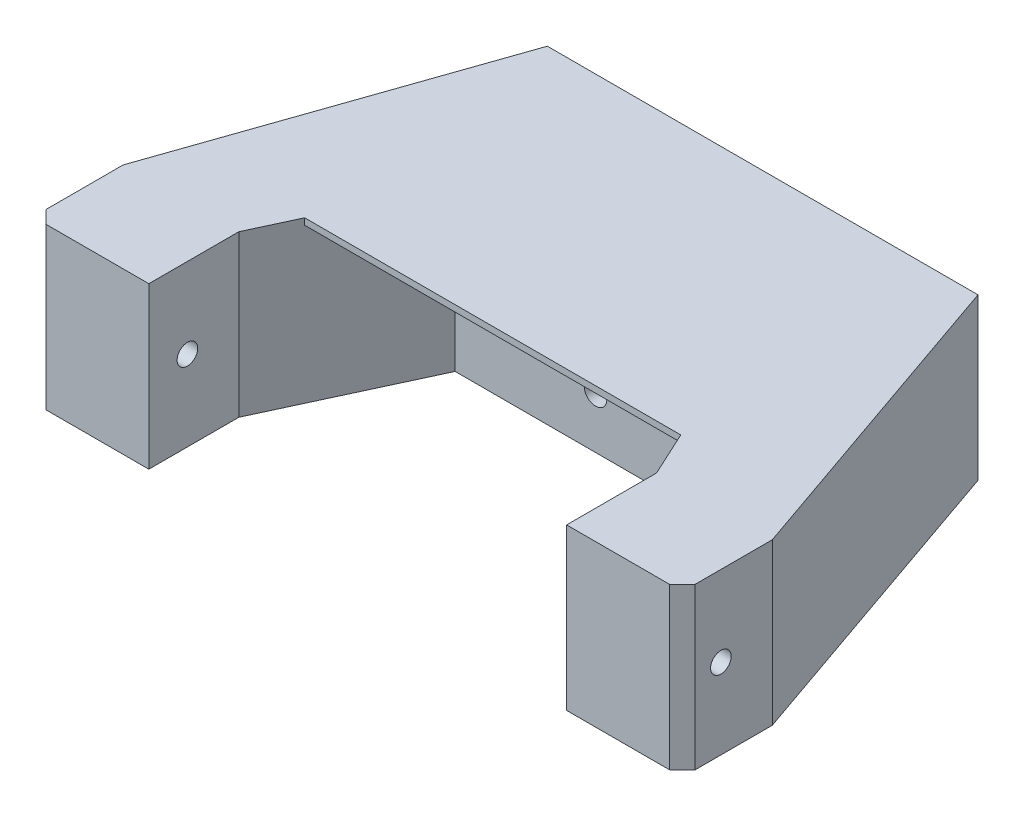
ISO-10303-21;
HEADER;
FILE_DESCRIPTION(('STEP AP214'),'2;1');
FILE_NAME('part.step','',(''),(''),'','','');
FILE_SCHEMA(('AUTOMOTIVE_DESIGN { 1 0 10303 214 1 1 1 1 }'));
ENDSEC;
DATA;
#1=APPLICATION_CONTEXT('core data for automotive mechanical design processes');
#2=APPLICATION_PROTOCOL_DEFINITION('international standard','automotive_design',2000,#1);
#3=PRODUCT_CONTEXT('',#1,'mechanical');
#4=PRODUCT('Part','Part','',(#3));
#5=PRODUCT_RELATED_PRODUCT_CATEGORY('part','',(#4));
#6=PRODUCT_DEFINITION_FORMATION('','',#4);
#7=PRODUCT_DEFINITION_CONTEXT('part definition',#1,'design');
#8=PRODUCT_DEFINITION('design','',#6,#7);
#9=PRODUCT_DEFINITION_SHAPE('','',#8);
#10=(LENGTH_UNIT() NAMED_UNIT(*) SI_UNIT(.MILLI.,.METRE.));
#11=(NAMED_UNIT(*) PLANE_ANGLE_UNIT() SI_UNIT($,.RADIAN.));
#12=(NAMED_UNIT(*) SI_UNIT($,.STERADIAN.) SOLID_ANGLE_UNIT());
#13=UNCERTAINTY_MEASURE_WITH_UNIT(LENGTH_MEASURE(1.E-05),#10,'distance_accuracy_value','');
#14=(GEOMETRIC_REPRESENTATION_CONTEXT(3) GLOBAL_UNCERTAINTY_ASSIGNED_CONTEXT((#13)) GLOBAL_UNIT_ASSIGNED_CONTEXT((#10,
#11,#12)) REPRESENTATION_CONTEXT('',''));
#15=CARTESIAN_POINT('',(0.,0.,0.));
#16=DIRECTION('',(0.,0.,1.));
#17=DIRECTION('',(1.,0.,0.));
#18=AXIS2_PLACEMENT_3D('',#15,#16,#17);
#19=CARTESIAN_POINT('',(0.,8.,5.00000000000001));
#20=DIRECTION('',(0.,0.,-1.));
#21=DIRECTION('',(-1.,0.,0.));
#22=AXIS2_PLACEMENT_3D('',#19,#20,#21);
#23=CYLINDRICAL_SURFACE('',#22,1.75);
#24=CARTESIAN_POINT('',(0.,8.,4.));
#25=DIRECTION('',(0.,0.,1.));
#26=DIRECTION('',(1.,0.,0.));
#27=AXIS2_PLACEMENT_3D('',#24,#25,#26);
#28=CIRCLE('',#27,1.75);
#29=CARTESIAN_POINT('',(1.75,8.,4.));
#30=VERTEX_POINT('',#29);
#31=EDGE_CURVE('E258',#30,#30,#28,.T.);
#32=ORIENTED_EDGE('',*,*,#31,.T.);
#33=EDGE_LOOP('',(#32));
#34=FACE_BOUND('',#33,.T.);
#35=CARTESIAN_POINT('',(0.,8.,-10.));
#36=DIRECTION('',(0.,0.,-1.));
#37=DIRECTION('',(-1.,0.,0.));
#38=AXIS2_PLACEMENT_3D('',#35,#36,#37);
#39=CIRCLE('',#38,1.75);
#40=CARTESIAN_POINT('',(-1.75,8.,-10.));
#41=VERTEX_POINT('',#40);
#42=EDGE_CURVE('E262',#41,#41,#39,.F.);
#43=ORIENTED_EDGE('',*,*,#42,.F.);
#44=EDGE_LOOP('',(#43));
#45=FACE_BOUND('',#44,.T.);
#46=ADVANCED_FACE('F38',(#34,#45),#23,.F.);
#47=CARTESIAN_POINT('',(25.,25.,-10.));
#48=DIRECTION('',(0.,-1.,0.));
#49=DIRECTION('',(0.,0.,-1.));
#50=AXIS2_PLACEMENT_3D('',#47,#48,#49);
#51=CYLINDRICAL_SURFACE('',#50,8.05);
#52=CARTESIAN_POINT('',(25.,0.,-10.));
#53=DIRECTION('',(0.,1.,0.));
#54=DIRECTION('',(0.,0.,1.));
#55=AXIS2_PLACEMENT_3D('',#52,#53,#54);
#56=CIRCLE('',#55,8.05);
#57=CARTESIAN_POINT('',(25.,0.,-1.95));
#58=VERTEX_POINT('',#57);
#59=EDGE_CURVE('E231',#58,#58,#56,.T.);
#60=ORIENTED_EDGE('',*,*,#59,.F.);
#61=EDGE_LOOP('',(#60));
#62=FACE_BOUND('',#61,.T.);
#63=CARTESIAN_POINT('',(25.,24.,-10.));
#64=DIRECTION('',(0.,1.,0.));
#65=DIRECTION('',(0.,0.,1.));
#66=AXIS2_PLACEMENT_3D('',#63,#64,#65);
#67=CIRCLE('',#66,8.05);
#68=CARTESIAN_POINT('',(25.,24.,-1.95));
#69=VERTEX_POINT('',#68);
#70=EDGE_CURVE('E195',#69,#69,#67,.T.);
#71=ORIENTED_EDGE('',*,*,#70,.T.);
#72=EDGE_LOOP('',(#71));
#73=FACE_BOUND('',#72,.T.);
#74=ADVANCED_FACE('F378',(#62,#73),#51,.F.);
#75=CARTESIAN_POINT('',(-25.,25.,-10.));
#76=DIRECTION('',(0.,-1.,0.));
#77=DIRECTION('',(0.,0.,-1.));
#78=AXIS2_PLACEMENT_3D('',#75,#76,#77);
#79=CYLINDRICAL_SURFACE('',#78,8.05);
#80=CARTESIAN_POINT('',(-25.,0.,-10.));
#81=DIRECTION('',(0.,1.,0.));
#82=DIRECTION('',(0.,0.,1.));
#83=AXIS2_PLACEMENT_3D('',#80,#81,#82);
#84=CIRCLE('',#83,8.05);
#85=CARTESIAN_POINT('',(-25.,0.,-1.95));
#86=VERTEX_POINT('',#85);
#87=EDGE_CURVE('E205',#86,#86,#84,.F.);
#88=ORIENTED_EDGE('',*,*,#87,.T.);
#89=EDGE_LOOP('',(#88));
#90=FACE_BOUND('',#89,.T.);
#91=CARTESIAN_POINT('',(-25.,24.,-10.));
#92=DIRECTION('',(0.,1.,0.));
#93=DIRECTION('',(0.,0.,1.));
#94=AXIS2_PLACEMENT_3D('',#91,#92,#93);
#95=CIRCLE('',#94,8.05);
#96=CARTESIAN_POINT('',(-25.,24.,-1.95));
#97=VERTEX_POINT('',#96);
#98=EDGE_CURVE('E250',#97,#97,#95,.F.);
#99=ORIENTED_EDGE('',*,*,#98,.F.);
#100=EDGE_LOOP('',(#99));
#101=FACE_BOUND('',#100,.T.);
#102=ADVANCED_FACE('F384',(#90,#101),#79,.F.);
#103=CARTESIAN_POINT('',(0.,25.,-22.));
#104=DIRECTION('',(0.,0.,-1.));
#105=DIRECTION('',(-1.,0.,0.));
#106=AXIS2_PLACEMENT_3D('',#103,#104,#105);
#107=PLANE('',#106);
#108=CARTESIAN_POINT('',(0.,8.,-22.));
#109=DIRECTION('',(0.,0.,-1.));
#110=DIRECTION('',(-1.,0.,0.));
#111=AXIS2_PLACEMENT_3D('',#108,#109,#110);
#112=CIRCLE('',#111,3.5);
#113=CARTESIAN_POINT('',(-3.5,8.,-22.));
#114=VERTEX_POINT('',#113);
#115=EDGE_CURVE('E336',#114,#114,#112,.T.);
#116=ORIENTED_EDGE('',*,*,#115,.F.);
#117=EDGE_LOOP('',(#116));
#118=FACE_BOUND('',#117,.T.);
#119=DIRECTION('',(1.,0.,0.));
#120=VECTOR('',#119,1.);
#121=CARTESIAN_POINT('',(0.,0.,-22.));
#122=LINE('',#121,#120);
#123=CARTESIAN_POINT('',(-33.5,0.,-22.));
#124=VERTEX_POINT('',#123);
#125=CARTESIAN_POINT('',(33.5,0.,-22.));
#126=VERTEX_POINT('',#125);
#127=EDGE_CURVE('E200',#124,#126,#122,.T.);
#128=ORIENTED_EDGE('',*,*,#127,.F.);
#129=DIRECTION('',(0.,-1.,0.));
#130=VECTOR('',#129,1.);
#131=CARTESIAN_POINT('',(-33.5,25.,-22.));
#132=LINE('',#131,#130);
#133=CARTESIAN_POINT('',(-33.5,25.,-22.));
#134=VERTEX_POINT('',#133);
#135=EDGE_CURVE('E248',#134,#124,#132,.T.);
#136=ORIENTED_EDGE('',*,*,#135,.F.);
#137=DIRECTION('',(1.,0.,0.));
#138=VECTOR('',#137,1.);
#139=CARTESIAN_POINT('',(0.,25.,-22.));
#140=LINE('',#139,#138);
#141=CARTESIAN_POINT('',(33.5,25.,-22.));
#142=VERTEX_POINT('',#141);
#143=EDGE_CURVE('E201',#134,#142,#140,.T.);
#144=ORIENTED_EDGE('',*,*,#143,.T.);
#145=DIRECTION('',(0.,-1.,0.));
#146=VECTOR('',#145,1.);
#147=CARTESIAN_POINT('',(33.5,25.,-22.));
#148=LINE('',#147,#146);
#149=EDGE_CURVE('E216',#142,#126,#148,.T.);
#150=ORIENTED_EDGE('',*,*,#149,.T.);
#151=EDGE_LOOP('',(#128,#136,#144,#150));
#152=FACE_BOUND('',#151,.T.);
#153=ADVANCED_FACE('F40',(#118,#152),#107,.T.);
#154=CARTESIAN_POINT('',(-36.7135687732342,25.,-12.7373605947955));
#155=DIRECTION('',(0.944756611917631,0.,0.327772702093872));
#156=DIRECTION('',(0.327772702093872,0.,-0.944756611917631));
#157=AXIS2_PLACEMENT_3D('',#154,#155,#156);
#158=PLANE('',#157);
#159=DIRECTION('',(-0.327772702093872,0.,0.944756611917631));
#160=VECTOR('',#159,1.);
#161=CARTESIAN_POINT('',(-36.7135687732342,0.,-12.7373605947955));
#162=LINE('',#161,#160);
#163=CARTESIAN_POINT('',(-50.5,0.,27.));
#164=VERTEX_POINT('',#163);
#165=EDGE_CURVE('E219',#124,#164,#162,.T.);
#166=ORIENTED_EDGE('',*,*,#165,.T.);
#167=DIRECTION('',(0.,-1.,0.));
#168=VECTOR('',#167,1.);
#169=CARTESIAN_POINT('',(-50.5,25.,27.));
#170=LINE('',#169,#168);
#171=CARTESIAN_POINT('',(-50.5,25.,27.));
#172=VERTEX_POINT('',#171);
#173=EDGE_CURVE('E245',#172,#164,#170,.T.);
#174=ORIENTED_EDGE('',*,*,#173,.F.);
#175=DIRECTION('',(-0.327772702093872,0.,0.944756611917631));
#176=VECTOR('',#175,1.);
#177=CARTESIAN_POINT('',(-36.7135687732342,25.,-12.7373605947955));
#178=LINE('',#177,#176);
#179=EDGE_CURVE('E204',#134,#172,#178,.T.);
#180=ORIENTED_EDGE('',*,*,#179,.F.);
#181=ORIENTED_EDGE('',*,*,#135,.T.);
#182=EDGE_LOOP('',(#166,#174,#180,#181));
#183=FACE_BOUND('',#182,.T.);
#184=ADVANCED_FACE('F352',(#183),#158,.F.);
#185=CARTESIAN_POINT('',(-16.469923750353,25.,-7.6249646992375));
#186=DIRECTION('',(-0.907466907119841,0.,-0.420123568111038));
#187=DIRECTION('',(-0.420123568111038,0.,0.907466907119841));
#188=AXIS2_PLACEMENT_3D('',#185,#186,#187);
#189=PLANE('',#188);
#190=DIRECTION('',(0.420123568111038,0.,-0.907466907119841));
#191=VECTOR('',#190,1.);
#192=CARTESIAN_POINT('',(-16.469923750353,0.,-7.6249646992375));
#193=LINE('',#192,#191);
#194=CARTESIAN_POINT('',(-32.5,0.,27.));
#195=VERTEX_POINT('',#194);
#196=CARTESIAN_POINT('',(-21.8518518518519,0.,3.99999999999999));
#197=VERTEX_POINT('',#196);
#198=EDGE_CURVE('E222',#195,#197,#193,.T.);
#199=ORIENTED_EDGE('',*,*,#198,.T.);
#200=DIRECTION('',(0.,-1.,0.));
#201=VECTOR('',#200,1.);
#202=CARTESIAN_POINT('',(-21.8518518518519,67.886372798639,3.99999999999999));
#203=LINE('',#202,#201);
#204=CARTESIAN_POINT('',(-21.8518518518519,24.,3.99999999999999));
#205=VERTEX_POINT('',#204);
#206=EDGE_CURVE('E330',#205,#197,#203,.T.);
#207=ORIENTED_EDGE('',*,*,#206,.F.);
#208=DIRECTION('',(-0.420123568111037,0.,0.907466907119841));
#209=VECTOR('',#208,1.);
#210=CARTESIAN_POINT('',(-20.,24.,0.));
#211=LINE('',#210,#209);
#212=CARTESIAN_POINT('',(-29.2592592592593,24.,20.));
#213=VERTEX_POINT('',#212);
#214=EDGE_CURVE('E183',#205,#213,#211,.T.);
#215=ORIENTED_EDGE('',*,*,#214,.T.);
#216=DIRECTION('',(0.,1.,0.));
#217=VECTOR('',#216,1.);
#218=CARTESIAN_POINT('',(-29.2592592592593,24.,20.));
#219=LINE('',#218,#217);
#220=CARTESIAN_POINT('',(-29.2592592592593,25.,20.));
#221=VERTEX_POINT('',#220);
#222=EDGE_CURVE('E190',#213,#221,#219,.T.);
#223=ORIENTED_EDGE('',*,*,#222,.T.);
#224=DIRECTION('',(0.420123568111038,0.,-0.907466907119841));
#225=VECTOR('',#224,1.);
#226=CARTESIAN_POINT('',(-16.469923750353,25.,-7.6249646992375));
#227=LINE('',#226,#225);
#228=CARTESIAN_POINT('',(-32.5,25.,27.));
#229=VERTEX_POINT('',#228);
#230=EDGE_CURVE('E207',#229,#221,#227,.T.);
#231=ORIENTED_EDGE('',*,*,#230,.F.);
#232=DIRECTION('',(0.,-1.,0.));
#233=VECTOR('',#232,1.);
#234=CARTESIAN_POINT('',(-32.5,25.,27.));
#235=LINE('',#234,#233);
#236=EDGE_CURVE('E242',#229,#195,#235,.T.);
#237=ORIENTED_EDGE('',*,*,#236,.T.);
#238=EDGE_LOOP('',(#199,#207,#215,#223,#231,#237));
#239=FACE_BOUND('',#238,.T.);
#240=ADVANCED_FACE('F299',(#239),#189,.F.);
#241=CARTESIAN_POINT('',(16.469923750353,25.,-7.6249646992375));
#242=DIRECTION('',(-0.907466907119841,0.,0.420123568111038));
#243=DIRECTION('',(0.420123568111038,0.,0.907466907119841));
#244=AXIS2_PLACEMENT_3D('',#241,#242,#243);
#245=PLANE('',#244);
#246=DIRECTION('',(0.,-1.,0.));
#247=VECTOR('',#246,1.);
#248=CARTESIAN_POINT('',(21.8518518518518,67.886372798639,4.));
#249=LINE('',#248,#247);
#250=CARTESIAN_POINT('',(21.8518518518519,24.,4.));
#251=VERTEX_POINT('',#250);
#252=CARTESIAN_POINT('',(21.8518518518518,0.,4.));
#253=VERTEX_POINT('',#252);
#254=EDGE_CURVE('E332',#251,#253,#249,.T.);
#255=ORIENTED_EDGE('',*,*,#254,.T.);
#256=DIRECTION('',(-0.420123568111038,0.,-0.907466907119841));
#257=VECTOR('',#256,1.);
#258=CARTESIAN_POINT('',(16.469923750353,0.,-7.6249646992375));
#259=LINE('',#258,#257);
#260=CARTESIAN_POINT('',(32.5,0.,27.));
#261=VERTEX_POINT('',#260);
#262=EDGE_CURVE('E225',#261,#253,#259,.T.);
#263=ORIENTED_EDGE('',*,*,#262,.F.);
#264=DIRECTION('',(0.,-1.,0.));
#265=VECTOR('',#264,1.);
#266=CARTESIAN_POINT('',(32.5,25.,27.));
#267=LINE('',#266,#265);
#268=CARTESIAN_POINT('',(32.5,25.,27.));
#269=VERTEX_POINT('',#268);
#270=EDGE_CURVE('E240',#269,#261,#267,.T.);
#271=ORIENTED_EDGE('',*,*,#270,.F.);
#272=DIRECTION('',(-0.420123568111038,0.,-0.907466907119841));
#273=VECTOR('',#272,1.);
#274=CARTESIAN_POINT('',(16.469923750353,25.,-7.6249646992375));
#275=LINE('',#274,#273);
#276=CARTESIAN_POINT('',(29.2592592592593,25.,20.));
#277=VERTEX_POINT('',#276);
#278=EDGE_CURVE('E210',#269,#277,#275,.T.);
#279=ORIENTED_EDGE('',*,*,#278,.T.);
#280=DIRECTION('',(0.,1.,0.));
#281=VECTOR('',#280,1.);
#282=CARTESIAN_POINT('',(29.2592592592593,24.,20.));
#283=LINE('',#282,#281);
#284=CARTESIAN_POINT('',(29.2592592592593,24.,20.));
#285=VERTEX_POINT('',#284);
#286=EDGE_CURVE('E193',#285,#277,#283,.T.);
#287=ORIENTED_EDGE('',*,*,#286,.F.);
#288=DIRECTION('',(-0.420123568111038,0.,-0.907466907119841));
#289=VECTOR('',#288,1.);
#290=CARTESIAN_POINT('',(29.2592592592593,24.,20.));
#291=LINE('',#290,#289);
#292=EDGE_CURVE('E187',#285,#251,#291,.T.);
#293=ORIENTED_EDGE('',*,*,#292,.T.);
#294=EDGE_LOOP('',(#255,#263,#271,#279,#287,#293));
#295=FACE_BOUND('',#294,.T.);
#296=ADVANCED_FACE('F314',(#295),#245,.T.);
#297=CARTESIAN_POINT('',(36.7135687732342,25.,-12.7373605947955));
#298=DIRECTION('',(0.944756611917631,0.,-0.327772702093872));
#299=DIRECTION('',(-0.327772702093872,0.,-0.944756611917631));
#300=AXIS2_PLACEMENT_3D('',#297,#298,#299);
#301=PLANE('',#300);
#302=DIRECTION('',(0.327772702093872,0.,0.944756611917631));
#303=VECTOR('',#302,1.);
#304=CARTESIAN_POINT('',(36.7135687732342,0.,-12.7373605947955));
#305=LINE('',#304,#303);
#306=CARTESIAN_POINT('',(50.5,0.,27.));
#307=VERTEX_POINT('',#306);
#308=EDGE_CURVE('E228',#126,#307,#305,.T.);
#309=ORIENTED_EDGE('',*,*,#308,.F.);
#310=ORIENTED_EDGE('',*,*,#149,.F.);
#311=DIRECTION('',(0.327772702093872,0.,0.944756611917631));
#312=VECTOR('',#311,1.);
#313=CARTESIAN_POINT('',(36.7135687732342,25.,-12.7373605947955));
#314=LINE('',#313,#312);
#315=CARTESIAN_POINT('',(50.5,25.,27.));
#316=VERTEX_POINT('',#315);
#317=EDGE_CURVE('E213',#142,#316,#314,.T.);
#318=ORIENTED_EDGE('',*,*,#317,.T.);
#319=DIRECTION('',(0.,-1.,0.));
#320=VECTOR('',#319,1.);
#321=CARTESIAN_POINT('',(50.5,25.,27.));
#322=LINE('',#321,#320);
#323=EDGE_CURVE('E237',#316,#307,#322,.T.);
#324=ORIENTED_EDGE('',*,*,#323,.T.);
#325=EDGE_LOOP('',(#309,#310,#318,#324));
#326=FACE_BOUND('',#325,.T.);
#327=ADVANCED_FACE('F359',(#326),#301,.T.);
#328=CARTESIAN_POINT('',(0.,25.,0.));
#329=DIRECTION('',(0.,1.,0.));
#330=DIRECTION('',(0.,0.,1.));
#331=AXIS2_PLACEMENT_3D('',#328,#329,#330);
#332=PLANE('',#331);
#333=DIRECTION('',(-0.707106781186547,0.,-0.707106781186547));
#334=VECTOR('',#333,1.);
#335=CARTESIAN_POINT('',(-50.5,25.,39.));
#336=LINE('',#335,#334);
#337=CARTESIAN_POINT('',(-48.5,25.,41.));
#338=VERTEX_POINT('',#337);
#339=CARTESIAN_POINT('',(-50.5,25.,39.));
#340=VERTEX_POINT('',#339);
#341=EDGE_CURVE('E149',#338,#340,#336,.T.);
#342=ORIENTED_EDGE('',*,*,#341,.F.);
#343=DIRECTION('',(-1.,0.,0.));
#344=VECTOR('',#343,1.);
#345=CARTESIAN_POINT('',(-50.5,25.,41.));
#346=LINE('',#345,#344);
#347=CARTESIAN_POINT('',(-32.5,25.,41.));
#348=VERTEX_POINT('',#347);
#349=EDGE_CURVE('E159',#348,#338,#346,.T.);
#350=ORIENTED_EDGE('',*,*,#349,.F.);
#351=DIRECTION('',(0.,0.,-1.));
#352=VECTOR('',#351,1.);
#353=CARTESIAN_POINT('',(-32.5,25.,41.));
#354=LINE('',#353,#352);
#355=EDGE_CURVE('E170',#348,#229,#354,.T.);
#356=ORIENTED_EDGE('',*,*,#355,.T.);
#357=ORIENTED_EDGE('',*,*,#230,.T.);
#358=DIRECTION('',(1.,0.,0.));
#359=VECTOR('',#358,1.);
#360=CARTESIAN_POINT('',(-29.2592592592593,25.,20.));
#361=LINE('',#360,#359);
#362=EDGE_CURVE('E182',#221,#277,#361,.T.);
#363=ORIENTED_EDGE('',*,*,#362,.T.);
#364=ORIENTED_EDGE('',*,*,#278,.F.);
#365=DIRECTION('',(0.,0.,-1.));
#366=VECTOR('',#365,1.);
#367=CARTESIAN_POINT('',(32.5,25.,41.));
#368=LINE('',#367,#366);
#369=CARTESIAN_POINT('',(32.5,25.,41.));
#370=VERTEX_POINT('',#369);
#371=EDGE_CURVE('E276',#370,#269,#368,.T.);
#372=ORIENTED_EDGE('',*,*,#371,.F.);
#373=DIRECTION('',(-1.,0.,0.));
#374=VECTOR('',#373,1.);
#375=CARTESIAN_POINT('',(32.5,25.,41.));
#376=LINE('',#375,#374);
#377=CARTESIAN_POINT('',(48.5,25.,41.));
#378=VERTEX_POINT('',#377);
#379=EDGE_CURVE('E270',#378,#370,#376,.T.);
#380=ORIENTED_EDGE('',*,*,#379,.F.);
#381=DIRECTION('',(-0.707106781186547,0.,0.707106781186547));
#382=VECTOR('',#381,1.);
#383=CARTESIAN_POINT('',(50.5,25.,39.));
#384=LINE('',#383,#382);
#385=CARTESIAN_POINT('',(50.5,25.,39.));
#386=VERTEX_POINT('',#385);
#387=EDGE_CURVE('E60',#386,#378,#384,.T.);
#388=ORIENTED_EDGE('',*,*,#387,.F.);
#389=DIRECTION('',(0.,0.,-1.));
#390=VECTOR('',#389,1.);
#391=CARTESIAN_POINT('',(50.5,25.,41.));
#392=LINE('',#391,#390);
#393=EDGE_CURVE('E279',#386,#316,#392,.T.);
#394=ORIENTED_EDGE('',*,*,#393,.T.);
#395=ORIENTED_EDGE('',*,*,#317,.F.);
#396=ORIENTED_EDGE('',*,*,#143,.F.);
#397=ORIENTED_EDGE('',*,*,#179,.T.);
#398=DIRECTION('',(0.,0.,-1.));
#399=VECTOR('',#398,1.);
#400=CARTESIAN_POINT('',(-50.5,25.,41.));
#401=LINE('',#400,#399);
#402=EDGE_CURVE('E161',#340,#172,#401,.T.);
#403=ORIENTED_EDGE('',*,*,#402,.F.);
#404=EDGE_LOOP('',(#342,#350,#356,#357,#363,#364,#372,#380,#388,#394,#395,#396,#397,#403));
#405=FACE_BOUND('',#404,.T.);
#406=ADVANCED_FACE('F157',(#405),#332,.T.);
#407=CARTESIAN_POINT('',(0.,0.,0.));
#408=DIRECTION('',(0.,1.,0.));
#409=DIRECTION('',(0.,0.,1.));
#410=AXIS2_PLACEMENT_3D('',#407,#408,#409);
#411=PLANE('',#410);
#412=DIRECTION('',(1.,0.,0.));
#413=VECTOR('',#412,1.);
#414=CARTESIAN_POINT('',(-50.5,0.,41.));
#415=LINE('',#414,#413);
#416=CARTESIAN_POINT('',(-48.5,0.,41.));
#417=VERTEX_POINT('',#416);
#418=CARTESIAN_POINT('',(-32.5,0.,41.));
#419=VERTEX_POINT('',#418);
#420=EDGE_CURVE('E172',#417,#419,#415,.T.);
#421=ORIENTED_EDGE('',*,*,#420,.F.);
#422=DIRECTION('',(-0.707106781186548,0.,-0.707106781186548));
#423=VECTOR('',#422,1.);
#424=CARTESIAN_POINT('',(-44.75,0.,44.75));
#425=LINE('',#424,#423);
#426=CARTESIAN_POINT('',(-50.5,0.,39.));
#427=VERTEX_POINT('',#426);
#428=EDGE_CURVE('E52',#417,#427,#425,.T.);
#429=ORIENTED_EDGE('',*,*,#428,.T.);
#430=DIRECTION('',(0.,0.,-1.));
#431=VECTOR('',#430,1.);
#432=CARTESIAN_POINT('',(-50.5,0.,41.));
#433=LINE('',#432,#431);
#434=EDGE_CURVE('E180',#427,#164,#433,.T.);
#435=ORIENTED_EDGE('',*,*,#434,.T.);
#436=ORIENTED_EDGE('',*,*,#165,.F.);
#437=ORIENTED_EDGE('',*,*,#127,.T.);
#438=ORIENTED_EDGE('',*,*,#308,.T.);
#439=DIRECTION('',(0.,0.,-1.));
#440=VECTOR('',#439,1.);
#441=CARTESIAN_POINT('',(50.5,0.,41.));
#442=LINE('',#441,#440);
#443=CARTESIAN_POINT('',(50.5,0.,39.));
#444=VERTEX_POINT('',#443);
#445=EDGE_CURVE('E286',#444,#307,#442,.T.);
#446=ORIENTED_EDGE('',*,*,#445,.F.);
#447=DIRECTION('',(-0.707106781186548,0.,0.707106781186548));
#448=VECTOR('',#447,1.);
#449=CARTESIAN_POINT('',(44.75,0.,44.75));
#450=LINE('',#449,#448);
#451=CARTESIAN_POINT('',(48.5,0.,41.));
#452=VERTEX_POINT('',#451);
#453=EDGE_CURVE('E321',#444,#452,#450,.T.);
#454=ORIENTED_EDGE('',*,*,#453,.T.);
#455=DIRECTION('',(1.,0.,0.));
#456=VECTOR('',#455,1.);
#457=CARTESIAN_POINT('',(32.5,0.,41.));
#458=LINE('',#457,#456);
#459=CARTESIAN_POINT('',(32.5,0.,41.));
#460=VERTEX_POINT('',#459);
#461=EDGE_CURVE('E272',#460,#452,#458,.T.);
#462=ORIENTED_EDGE('',*,*,#461,.F.);
#463=DIRECTION('',(0.,0.,-1.));
#464=VECTOR('',#463,1.);
#465=CARTESIAN_POINT('',(32.5,0.,41.));
#466=LINE('',#465,#464);
#467=EDGE_CURVE('E288',#460,#261,#466,.T.);
#468=ORIENTED_EDGE('',*,*,#467,.T.);
#469=ORIENTED_EDGE('',*,*,#262,.T.);
#470=DIRECTION('',(-1.,0.,0.));
#471=VECTOR('',#470,1.);
#472=CARTESIAN_POINT('',(21.8518518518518,0.,4.));
#473=LINE('',#472,#471);
#474=EDGE_CURVE('E261',#253,#197,#473,.T.);
#475=ORIENTED_EDGE('',*,*,#474,.T.);
#476=ORIENTED_EDGE('',*,*,#198,.F.);
#477=DIRECTION('',(0.,0.,-1.));
#478=VECTOR('',#477,1.);
#479=CARTESIAN_POINT('',(-32.5,0.,41.));
#480=LINE('',#479,#478);
#481=EDGE_CURVE('E177',#419,#195,#480,.T.);
#482=ORIENTED_EDGE('',*,*,#481,.F.);
#483=EDGE_LOOP('',(#421,#429,#435,#436,#437,#438,#446,#454,#462,#468,#469,#475,#476,#482));
#484=FACE_BOUND('',#483,.T.);
#485=ORIENTED_EDGE('',*,*,#59,.T.);
#486=EDGE_LOOP('',(#485));
#487=FACE_BOUND('',#486,.T.);
#488=ORIENTED_EDGE('',*,*,#87,.F.);
#489=EDGE_LOOP('',(#488));
#490=FACE_BOUND('',#489,.T.);
#491=ADVANCED_FACE('F292',(#484,#487,#490),#411,.F.);
#492=CARTESIAN_POINT('',(-25.,24.,-10.));
#493=DIRECTION('',(0.,1.,0.));
#494=DIRECTION('',(0.,0.,1.));
#495=AXIS2_PLACEMENT_3D('',#492,#493,#494);
#496=PLANE('',#495);
#497=ORIENTED_EDGE('',*,*,#98,.T.);
#498=EDGE_LOOP('',(#497));
#499=FACE_BOUND('',#498,.T.);
#500=ADVANCED_FACE('F421',(#499),#496,.F.);
#501=CARTESIAN_POINT('',(25.,24.,-10.));
#502=DIRECTION('',(0.,1.,0.));
#503=DIRECTION('',(0.,0.,1.));
#504=AXIS2_PLACEMENT_3D('',#501,#502,#503);
#505=PLANE('',#504);
#506=ORIENTED_EDGE('',*,*,#70,.F.);
#507=EDGE_LOOP('',(#506));
#508=FACE_BOUND('',#507,.T.);
#509=ADVANCED_FACE('F418',(#508),#505,.F.);
#510=CARTESIAN_POINT('',(-29.2592592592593,24.,20.));
#511=DIRECTION('',(0.,0.,1.));
#512=DIRECTION('',(1.,0.,0.));
#513=AXIS2_PLACEMENT_3D('',#510,#511,#512);
#514=PLANE('',#513);
#515=ORIENTED_EDGE('',*,*,#362,.F.);
#516=ORIENTED_EDGE('',*,*,#222,.F.);
#517=DIRECTION('',(1.,0.,0.));
#518=VECTOR('',#517,1.);
#519=CARTESIAN_POINT('',(-29.2592592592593,24.,20.));
#520=LINE('',#519,#518);
#521=EDGE_CURVE('E185',#213,#285,#520,.T.);
#522=ORIENTED_EDGE('',*,*,#521,.T.);
#523=ORIENTED_EDGE('',*,*,#286,.T.);
#524=EDGE_LOOP('',(#515,#516,#522,#523));
#525=FACE_BOUND('',#524,.T.);
#526=ADVANCED_FACE('F305',(#525),#514,.T.);
#527=CARTESIAN_POINT('',(0.,24.,0.));
#528=DIRECTION('',(0.,1.,0.));
#529=DIRECTION('',(0.,0.,1.));
#530=AXIS2_PLACEMENT_3D('',#527,#528,#529);
#531=PLANE('',#530);
#532=ORIENTED_EDGE('',*,*,#214,.F.);
#533=DIRECTION('',(-1.,0.,0.));
#534=VECTOR('',#533,1.);
#535=CARTESIAN_POINT('',(21.8518518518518,24.,4.));
#536=LINE('',#535,#534);
#537=EDGE_CURVE('E311',#251,#205,#536,.T.);
#538=ORIENTED_EDGE('',*,*,#537,.F.);
#539=ORIENTED_EDGE('',*,*,#292,.F.);
#540=ORIENTED_EDGE('',*,*,#521,.F.);
#541=EDGE_LOOP('',(#532,#538,#539,#540));
#542=FACE_BOUND('',#541,.T.);
#543=ADVANCED_FACE('F308',(#542),#531,.F.);
#544=CARTESIAN_POINT('',(-50.5,25.,41.));
#545=DIRECTION('',(1.,0.,0.));
#546=DIRECTION('',(0.,0.,-1.));
#547=AXIS2_PLACEMENT_3D('',#544,#545,#546);
#548=PLANE('',#547);
#549=CARTESIAN_POINT('',(-50.5,12.5,35.));
#550=DIRECTION('',(-1.,0.,0.));
#551=DIRECTION('',(0.,0.,1.));
#552=AXIS2_PLACEMENT_3D('',#549,#550,#551);
#553=CIRCLE('',#552,1.6);
#554=CARTESIAN_POINT('',(-50.5,12.5,36.6));
#555=VERTEX_POINT('',#554);
#556=EDGE_CURVE('E257',#555,#555,#553,.T.);
#557=ORIENTED_EDGE('',*,*,#556,.F.);
#558=EDGE_LOOP('',(#557));
#559=FACE_BOUND('',#558,.T.);
#560=ORIENTED_EDGE('',*,*,#434,.F.);
#561=DIRECTION('',(0.,1.,0.));
#562=VECTOR('',#561,1.);
#563=CARTESIAN_POINT('',(-50.5,-60.,39.));
#564=LINE('',#563,#562);
#565=EDGE_CURVE('E162',#427,#340,#564,.T.);
#566=ORIENTED_EDGE('',*,*,#565,.T.);
#567=ORIENTED_EDGE('',*,*,#402,.T.);
#568=ORIENTED_EDGE('',*,*,#173,.T.);
#569=EDGE_LOOP('',(#560,#566,#567,#568));
#570=FACE_BOUND('',#569,.T.);
#571=ADVANCED_FACE('F347',(#559,#570),#548,.F.);
#572=CARTESIAN_POINT('',(-32.5,25.,41.));
#573=DIRECTION('',(-1.,0.,0.));
#574=DIRECTION('',(0.,0.,1.));
#575=AXIS2_PLACEMENT_3D('',#572,#573,#574);
#576=PLANE('',#575);
#577=CARTESIAN_POINT('',(-32.5,12.5,35.));
#578=DIRECTION('',(-1.,0.,0.));
#579=DIRECTION('',(0.,0.,1.));
#580=AXIS2_PLACEMENT_3D('',#577,#578,#579);
#581=CIRCLE('',#580,1.6);
#582=CARTESIAN_POINT('',(-32.5,12.5,36.6));
#583=VERTEX_POINT('',#582);
#584=EDGE_CURVE('E322',#583,#583,#581,.T.);
#585=ORIENTED_EDGE('',*,*,#584,.T.);
#586=EDGE_LOOP('',(#585));
#587=FACE_BOUND('',#586,.T.);
#588=ORIENTED_EDGE('',*,*,#236,.F.);
#589=ORIENTED_EDGE('',*,*,#355,.F.);
#590=DIRECTION('',(0.,1.,0.));
#591=VECTOR('',#590,1.);
#592=CARTESIAN_POINT('',(-32.5,25.,41.));
#593=LINE('',#592,#591);
#594=EDGE_CURVE('E167',#419,#348,#593,.T.);
#595=ORIENTED_EDGE('',*,*,#594,.F.);
#596=ORIENTED_EDGE('',*,*,#481,.T.);
#597=EDGE_LOOP('',(#588,#589,#595,#596));
#598=FACE_BOUND('',#597,.T.);
#599=ADVANCED_FACE('F297',(#587,#598),#576,.F.);
#600=CARTESIAN_POINT('',(0.,0.,41.));
#601=DIRECTION('',(0.,0.,1.));
#602=DIRECTION('',(1.,0.,0.));
#603=AXIS2_PLACEMENT_3D('',#600,#601,#602);
#604=PLANE('',#603);
#605=DIRECTION('',(0.,1.,0.));
#606=VECTOR('',#605,1.);
#607=CARTESIAN_POINT('',(-48.5,0.,41.));
#608=LINE('',#607,#606);
#609=EDGE_CURVE('E11',#417,#338,#608,.T.);
#610=ORIENTED_EDGE('',*,*,#609,.F.);
#611=ORIENTED_EDGE('',*,*,#420,.T.);
#612=ORIENTED_EDGE('',*,*,#594,.T.);
#613=ORIENTED_EDGE('',*,*,#349,.T.);
#614=EDGE_LOOP('',(#610,#611,#612,#613));
#615=FACE_BOUND('',#614,.T.);
#616=ADVANCED_FACE('F165',(#615),#604,.T.);
#617=CARTESIAN_POINT('',(32.5,0.,41.));
#618=DIRECTION('',(1.,0.,0.));
#619=DIRECTION('',(0.,0.,-1.));
#620=AXIS2_PLACEMENT_3D('',#617,#618,#619);
#621=PLANE('',#620);
#622=CARTESIAN_POINT('',(32.5,12.5,35.));
#623=DIRECTION('',(1.,0.,0.));
#624=DIRECTION('',(0.,0.,-1.));
#625=AXIS2_PLACEMENT_3D('',#622,#623,#624);
#626=CIRCLE('',#625,1.6);
#627=CARTESIAN_POINT('',(32.5,12.5,33.4));
#628=VERTEX_POINT('',#627);
#629=EDGE_CURVE('E256',#628,#628,#626,.T.);
#630=ORIENTED_EDGE('',*,*,#629,.T.);
#631=EDGE_LOOP('',(#630));
#632=FACE_BOUND('',#631,.T.);
#633=ORIENTED_EDGE('',*,*,#270,.T.);
#634=ORIENTED_EDGE('',*,*,#467,.F.);
#635=DIRECTION('',(0.,-1.,0.));
#636=VECTOR('',#635,1.);
#637=CARTESIAN_POINT('',(32.5,0.,41.));
#638=LINE('',#637,#636);
#639=EDGE_CURVE('E281',#370,#460,#638,.T.);
#640=ORIENTED_EDGE('',*,*,#639,.F.);
#641=ORIENTED_EDGE('',*,*,#371,.T.);
#642=EDGE_LOOP('',(#633,#634,#640,#641));
#643=FACE_BOUND('',#642,.T.);
#644=ADVANCED_FACE('F319',(#632,#643),#621,.F.);
#645=CARTESIAN_POINT('',(50.5,0.,41.));
#646=DIRECTION('',(-1.,0.,0.));
#647=DIRECTION('',(0.,0.,1.));
#648=AXIS2_PLACEMENT_3D('',#645,#646,#647);
#649=PLANE('',#648);
#650=CARTESIAN_POINT('',(50.5,12.5,35.));
#651=DIRECTION('',(-1.,0.,0.));
#652=DIRECTION('',(0.,0.,1.));
#653=AXIS2_PLACEMENT_3D('',#650,#651,#652);
#654=CIRCLE('',#653,1.6);
#655=CARTESIAN_POINT('',(50.5,12.5,36.6));
#656=VERTEX_POINT('',#655);
#657=EDGE_CURVE('E253',#656,#656,#654,.T.);
#658=ORIENTED_EDGE('',*,*,#657,.T.);
#659=EDGE_LOOP('',(#658));
#660=FACE_BOUND('',#659,.T.);
#661=ORIENTED_EDGE('',*,*,#393,.F.);
#662=DIRECTION('',(0.,1.,0.));
#663=VECTOR('',#662,1.);
#664=CARTESIAN_POINT('',(50.5,-60.,39.));
#665=LINE('',#664,#663);
#666=EDGE_CURVE('E163',#444,#386,#665,.T.);
#667=ORIENTED_EDGE('',*,*,#666,.F.);
#668=ORIENTED_EDGE('',*,*,#445,.T.);
#669=ORIENTED_EDGE('',*,*,#323,.F.);
#670=EDGE_LOOP('',(#661,#667,#668,#669));
#671=FACE_BOUND('',#670,.T.);
#672=ADVANCED_FACE('F362',(#660,#671),#649,.F.);
#673=CARTESIAN_POINT('',(0.,0.,41.));
#674=DIRECTION('',(0.,0.,-1.));
#675=DIRECTION('',(-1.,0.,0.));
#676=AXIS2_PLACEMENT_3D('',#673,#674,#675);
#677=PLANE('',#676);
#678=ORIENTED_EDGE('',*,*,#461,.T.);
#679=DIRECTION('',(0.,1.,0.));
#680=VECTOR('',#679,1.);
#681=CARTESIAN_POINT('',(48.5,0.,41.));
#682=LINE('',#681,#680);
#683=EDGE_CURVE('E46',#452,#378,#682,.T.);
#684=ORIENTED_EDGE('',*,*,#683,.T.);
#685=ORIENTED_EDGE('',*,*,#379,.T.);
#686=ORIENTED_EDGE('',*,*,#639,.T.);
#687=EDGE_LOOP('',(#678,#684,#685,#686));
#688=FACE_BOUND('',#687,.T.);
#689=ADVANCED_FACE('F268',(#688),#677,.F.);
#690=CARTESIAN_POINT('',(180.5,12.5,35.));
#691=DIRECTION('',(-1.,0.,0.));
#692=DIRECTION('',(0.,0.,1.));
#693=AXIS2_PLACEMENT_3D('',#690,#691,#692);
#694=CYLINDRICAL_SURFACE('',#693,1.6);
#695=ORIENTED_EDGE('',*,*,#657,.F.);
#696=EDGE_LOOP('',(#695));
#697=FACE_BOUND('',#696,.T.);
#698=ORIENTED_EDGE('',*,*,#629,.F.);
#699=EDGE_LOOP('',(#698));
#700=FACE_BOUND('',#699,.T.);
#701=ADVANCED_FACE('F396',(#697,#700),#694,.F.);
#702=ORIENTED_EDGE('',*,*,#556,.T.);
#703=EDGE_LOOP('',(#702));
#704=FACE_BOUND('',#703,.T.);
#705=ORIENTED_EDGE('',*,*,#584,.F.);
#706=EDGE_LOOP('',(#705));
#707=FACE_BOUND('',#706,.T.);
#708=ADVANCED_FACE('F392',(#704,#707),#694,.F.);
#709=CARTESIAN_POINT('',(21.8518518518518,67.886372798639,4.));
#710=DIRECTION('',(0.,0.,1.));
#711=DIRECTION('',(1.,0.,0.));
#712=AXIS2_PLACEMENT_3D('',#709,#710,#711);
#713=PLANE('',#712);
#714=ORIENTED_EDGE('',*,*,#31,.F.);
#715=EDGE_LOOP('',(#714));
#716=FACE_BOUND('',#715,.T.);
#717=ORIENTED_EDGE('',*,*,#254,.F.);
#718=ORIENTED_EDGE('',*,*,#537,.T.);
#719=ORIENTED_EDGE('',*,*,#206,.T.);
#720=ORIENTED_EDGE('',*,*,#474,.F.);
#721=EDGE_LOOP('',(#717,#718,#719,#720));
#722=FACE_BOUND('',#721,.T.);
#723=ADVANCED_FACE('F389',(#716,#722),#713,.T.);
#724=CARTESIAN_POINT('',(0.,8.,-10.));
#725=DIRECTION('',(0.,0.,-1.));
#726=DIRECTION('',(-1.,0.,0.));
#727=AXIS2_PLACEMENT_3D('',#724,#725,#726);
#728=PLANE('',#727);
#729=CARTESIAN_POINT('',(0.,8.,-10.));
#730=DIRECTION('',(0.,0.,-1.));
#731=DIRECTION('',(-1.,0.,0.));
#732=AXIS2_PLACEMENT_3D('',#729,#730,#731);
#733=CIRCLE('',#732,3.5);
#734=CARTESIAN_POINT('',(-3.5,8.,-10.));
#735=VERTEX_POINT('',#734);
#736=EDGE_CURVE('E264',#735,#735,#733,.T.);
#737=ORIENTED_EDGE('',*,*,#736,.T.);
#738=EDGE_LOOP('',(#737));
#739=FACE_BOUND('',#738,.T.);
#740=ORIENTED_EDGE('',*,*,#42,.T.);
#741=EDGE_LOOP('',(#740));
#742=FACE_BOUND('',#741,.T.);
#743=ADVANCED_FACE('F373',(#739,#742),#728,.T.);
#744=CARTESIAN_POINT('',(0.,8.,-10.));
#745=DIRECTION('',(0.,0.,-1.));
#746=DIRECTION('',(-1.,0.,0.));
#747=AXIS2_PLACEMENT_3D('',#744,#745,#746);
#748=CYLINDRICAL_SURFACE('',#747,3.5);
#749=ORIENTED_EDGE('',*,*,#736,.F.);
#750=EDGE_LOOP('',(#749));
#751=FACE_BOUND('',#750,.T.);
#752=ORIENTED_EDGE('',*,*,#115,.T.);
#753=EDGE_LOOP('',(#752));
#754=FACE_BOUND('',#753,.T.);
#755=ADVANCED_FACE('F366',(#751,#754),#748,.F.);
#756=CARTESIAN_POINT('',(50.5,-60.,39.));
#757=DIRECTION('',(-0.707106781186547,0.,-0.707106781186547));
#758=DIRECTION('',(-0.707106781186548,0.,0.707106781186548));
#759=AXIS2_PLACEMENT_3D('',#756,#757,#758);
#760=PLANE('',#759);
#761=ORIENTED_EDGE('',*,*,#666,.T.);
#762=ORIENTED_EDGE('',*,*,#387,.T.);
#763=ORIENTED_EDGE('',*,*,#683,.F.);
#764=ORIENTED_EDGE('',*,*,#453,.F.);
#765=EDGE_LOOP('',(#761,#762,#763,#764));
#766=FACE_BOUND('',#765,.T.);
#767=ADVANCED_FACE('F364',(#766),#760,.F.);
#768=CARTESIAN_POINT('',(-50.5,-60.,39.));
#769=DIRECTION('',(0.707106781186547,0.,-0.707106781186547));
#770=DIRECTION('',(-0.707106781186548,0.,-0.707106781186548));
#771=AXIS2_PLACEMENT_3D('',#768,#769,#770);
#772=PLANE('',#771);
#773=ORIENTED_EDGE('',*,*,#609,.T.);
#774=ORIENTED_EDGE('',*,*,#341,.T.);
#775=ORIENTED_EDGE('',*,*,#565,.F.);
#776=ORIENTED_EDGE('',*,*,#428,.F.);
#777=EDGE_LOOP('',(#773,#774,#775,#776));
#778=FACE_BOUND('',#777,.T.);
#779=ADVANCED_FACE('F148',(#778),#772,.F.);
#780=CLOSED_SHELL('',(#46,#74,#102,#153,#184,#240,#296,#327,#406,#491,#500,#509,#526,#543,#571,
#599,#616,#644,#672,#689,#701,#708,#723,#743,#755,#767,#779));
#781=MANIFOLD_SOLID_BREP('B2',#780);
#782=ADVANCED_BREP_SHAPE_REPRESENTATION('',(#18,#781),#14);
#783=SHAPE_DEFINITION_REPRESENTATION(#9,#782);
ENDSEC;
END-ISO-10303-21;
